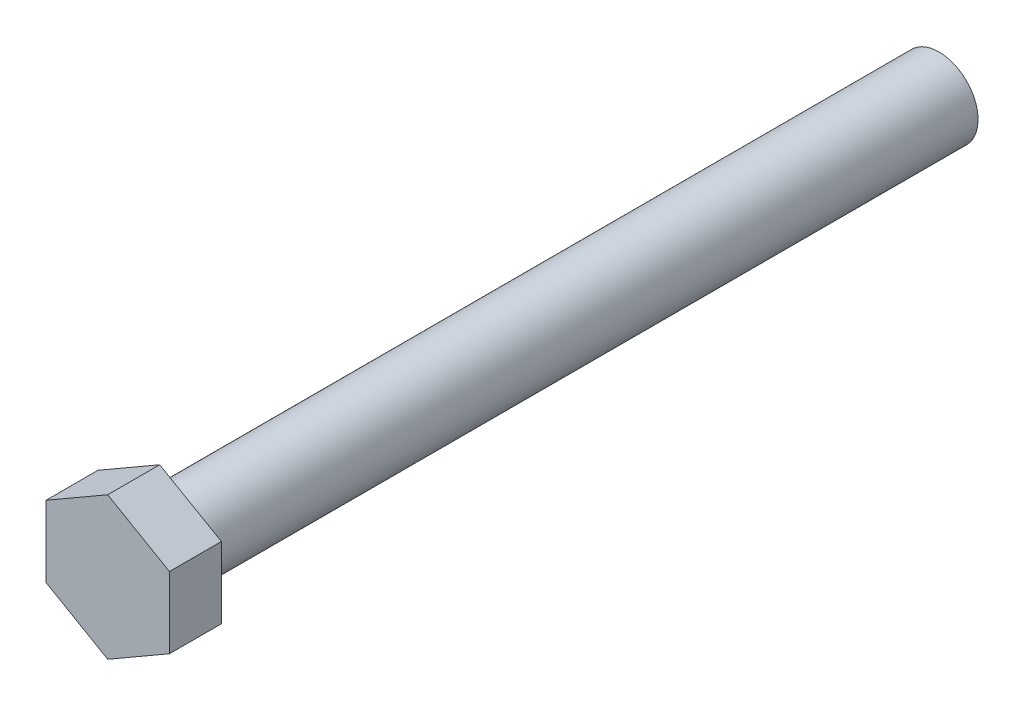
ISO-10303-21;
HEADER;
FILE_DESCRIPTION(('STEP AP214'),'2;1');
FILE_NAME('part.step','',(''),(''),'','','');
FILE_SCHEMA(('AUTOMOTIVE_DESIGN { 1 0 10303 214 1 1 1 1 }'));
ENDSEC;
DATA;
#1=APPLICATION_CONTEXT('core data for automotive mechanical design processes');
#2=APPLICATION_PROTOCOL_DEFINITION('international standard','automotive_design',2000,#1);
#3=PRODUCT_CONTEXT('',#1,'mechanical');
#4=PRODUCT('Part','Part','',(#3));
#5=PRODUCT_RELATED_PRODUCT_CATEGORY('part','',(#4));
#6=PRODUCT_DEFINITION_FORMATION('','',#4);
#7=PRODUCT_DEFINITION_CONTEXT('part definition',#1,'design');
#8=PRODUCT_DEFINITION('design','',#6,#7);
#9=PRODUCT_DEFINITION_SHAPE('','',#8);
#10=(LENGTH_UNIT() NAMED_UNIT(*) SI_UNIT(.MILLI.,.METRE.));
#11=(NAMED_UNIT(*) PLANE_ANGLE_UNIT() SI_UNIT($,.RADIAN.));
#12=(NAMED_UNIT(*) SI_UNIT($,.STERADIAN.) SOLID_ANGLE_UNIT());
#13=UNCERTAINTY_MEASURE_WITH_UNIT(LENGTH_MEASURE(1.E-05),#10,'distance_accuracy_value','');
#14=(GEOMETRIC_REPRESENTATION_CONTEXT(3) GLOBAL_UNCERTAINTY_ASSIGNED_CONTEXT((#13)) GLOBAL_UNIT_ASSIGNED_CONTEXT((#10,
#11,#12)) REPRESENTATION_CONTEXT('',''));
#15=CARTESIAN_POINT('',(0.,0.,0.));
#16=DIRECTION('',(0.,0.,1.));
#17=DIRECTION('',(1.,0.,0.));
#18=AXIS2_PLACEMENT_3D('',#15,#16,#17);
#19=CARTESIAN_POINT('',(0.,10.9696551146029,0.));
#20=DIRECTION('',(0.,0.,1.));
#21=DIRECTION('',(1.,0.,0.));
#22=AXIS2_PLACEMENT_3D('',#19,#20,#21);
#23=PLANE('',#22);
#24=DIRECTION('',(0.866025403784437,0.5,0.));
#25=VECTOR('',#24,1.);
#26=CARTESIAN_POINT('',(-9.5,5.48482755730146,0.));
#27=LINE('',#26,#25);
#28=CARTESIAN_POINT('',(-9.5,5.48482755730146,0.));
#29=VERTEX_POINT('',#28);
#30=CARTESIAN_POINT('',(0.,10.9696551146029,0.));
#31=VERTEX_POINT('',#30);
#32=EDGE_CURVE('E69',#29,#31,#27,.T.);
#33=ORIENTED_EDGE('',*,*,#32,.T.);
#34=DIRECTION('',(-0.866025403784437,0.5,0.));
#35=VECTOR('',#34,1.);
#36=CARTESIAN_POINT('',(9.5,5.48482755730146,0.));
#37=LINE('',#36,#35);
#38=CARTESIAN_POINT('',(9.5,5.48482755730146,0.));
#39=VERTEX_POINT('',#38);
#40=EDGE_CURVE('E83',#39,#31,#37,.T.);
#41=ORIENTED_EDGE('',*,*,#40,.F.);
#42=DIRECTION('',(0.,-1.,0.));
#43=VECTOR('',#42,1.);
#44=CARTESIAN_POINT('',(9.5,5.48482755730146,0.));
#45=LINE('',#44,#43);
#46=CARTESIAN_POINT('',(9.5,-5.48482755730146,0.));
#47=VERTEX_POINT('',#46);
#48=EDGE_CURVE('E90',#39,#47,#45,.T.);
#49=ORIENTED_EDGE('',*,*,#48,.T.);
#50=DIRECTION('',(-0.866025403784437,-0.5,0.));
#51=VECTOR('',#50,1.);
#52=CARTESIAN_POINT('',(9.5,-5.48482755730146,0.));
#53=LINE('',#52,#51);
#54=CARTESIAN_POINT('',(0.,-10.9696551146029,0.));
#55=VERTEX_POINT('',#54);
#56=EDGE_CURVE('E92',#47,#55,#53,.T.);
#57=ORIENTED_EDGE('',*,*,#56,.T.);
#58=DIRECTION('',(0.866025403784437,-0.5,0.));
#59=VECTOR('',#58,1.);
#60=CARTESIAN_POINT('',(-9.5,-5.48482755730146,0.));
#61=LINE('',#60,#59);
#62=CARTESIAN_POINT('',(-9.5,-5.48482755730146,0.));
#63=VERTEX_POINT('',#62);
#64=EDGE_CURVE('E98',#63,#55,#61,.T.);
#65=ORIENTED_EDGE('',*,*,#64,.F.);
#66=DIRECTION('',(0.,-1.,0.));
#67=VECTOR('',#66,1.);
#68=CARTESIAN_POINT('',(-9.5,5.48482755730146,0.));
#69=LINE('',#68,#67);
#70=EDGE_CURVE('E86',#29,#63,#69,.T.);
#71=ORIENTED_EDGE('',*,*,#70,.F.);
#72=EDGE_LOOP('',(#33,#41,#49,#57,#65,#71));
#73=FACE_BOUND('',#72,.T.);
#74=CARTESIAN_POINT('',(0.,0.,0.));
#75=DIRECTION('',(0.,0.,-1.));
#76=DIRECTION('',(-1.,0.,0.));
#77=AXIS2_PLACEMENT_3D('',#74,#75,#76);
#78=CIRCLE('',#77,6.);
#79=CARTESIAN_POINT('',(-6.,0.,0.));
#80=VERTEX_POINT('',#79);
#81=EDGE_CURVE('E9',#80,#80,#78,.T.);
#82=ORIENTED_EDGE('',*,*,#81,.F.);
#83=EDGE_LOOP('',(#82));
#84=FACE_BOUND('',#83,.T.);
#85=ADVANCED_FACE('F14',(#73,#84),#23,.F.);
#86=CARTESIAN_POINT('',(-9.5,5.48482755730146,8.));
#87=DIRECTION('',(-0.5,0.866025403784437,0.));
#88=DIRECTION('',(-0.866025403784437,-0.5,0.));
#89=AXIS2_PLACEMENT_3D('',#86,#87,#88);
#90=PLANE('',#89);
#91=DIRECTION('',(0.,0.,-1.));
#92=VECTOR('',#91,1.);
#93=CARTESIAN_POINT('',(-9.5,5.48482755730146,8.));
#94=LINE('',#93,#92);
#95=CARTESIAN_POINT('',(-9.5,5.48482755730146,8.));
#96=VERTEX_POINT('',#95);
#97=EDGE_CURVE('E18',#96,#29,#94,.T.);
#98=ORIENTED_EDGE('',*,*,#97,.F.);
#99=DIRECTION('',(0.866025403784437,0.5,0.));
#100=VECTOR('',#99,1.);
#101=CARTESIAN_POINT('',(-9.5,5.48482755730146,8.));
#102=LINE('',#101,#100);
#103=CARTESIAN_POINT('',(0.,10.9696551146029,8.));
#104=VERTEX_POINT('',#103);
#105=EDGE_CURVE('E71',#96,#104,#102,.T.);
#106=ORIENTED_EDGE('',*,*,#105,.T.);
#107=DIRECTION('',(0.,0.,-1.));
#108=VECTOR('',#107,1.);
#109=CARTESIAN_POINT('',(0.,10.9696551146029,8.));
#110=LINE('',#109,#108);
#111=EDGE_CURVE('E66',#104,#31,#110,.T.);
#112=ORIENTED_EDGE('',*,*,#111,.T.);
#113=ORIENTED_EDGE('',*,*,#32,.F.);
#114=EDGE_LOOP('',(#98,#106,#112,#113));
#115=FACE_BOUND('',#114,.T.);
#116=ADVANCED_FACE('F68',(#115),#90,.T.);
#117=CARTESIAN_POINT('',(-9.5,5.48482755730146,8.));
#118=DIRECTION('',(1.,0.,0.));
#119=DIRECTION('',(0.,0.,-1.));
#120=AXIS2_PLACEMENT_3D('',#117,#118,#119);
#121=PLANE('',#120);
#122=DIRECTION('',(0.,0.,-1.));
#123=VECTOR('',#122,1.);
#124=CARTESIAN_POINT('',(-9.5,-5.48482755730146,8.));
#125=LINE('',#124,#123);
#126=CARTESIAN_POINT('',(-9.5,-5.48482755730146,8.));
#127=VERTEX_POINT('',#126);
#128=EDGE_CURVE('E37',#127,#63,#125,.T.);
#129=ORIENTED_EDGE('',*,*,#128,.F.);
#130=DIRECTION('',(0.,-1.,0.));
#131=VECTOR('',#130,1.);
#132=CARTESIAN_POINT('',(-9.5,5.48482755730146,8.));
#133=LINE('',#132,#131);
#134=EDGE_CURVE('E77',#96,#127,#133,.T.);
#135=ORIENTED_EDGE('',*,*,#134,.F.);
#136=ORIENTED_EDGE('',*,*,#97,.T.);
#137=ORIENTED_EDGE('',*,*,#70,.T.);
#138=EDGE_LOOP('',(#129,#135,#136,#137));
#139=FACE_BOUND('',#138,.T.);
#140=ADVANCED_FACE('F16',(#139),#121,.F.);
#141=CARTESIAN_POINT('',(-9.5,-5.48482755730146,8.));
#142=DIRECTION('',(0.5,0.866025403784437,0.));
#143=DIRECTION('',(-0.866025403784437,0.5,0.));
#144=AXIS2_PLACEMENT_3D('',#141,#142,#143);
#145=PLANE('',#144);
#146=DIRECTION('',(0.,0.,-1.));
#147=VECTOR('',#146,1.);
#148=CARTESIAN_POINT('',(0.,-10.9696551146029,8.));
#149=LINE('',#148,#147);
#150=CARTESIAN_POINT('',(0.,-10.9696551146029,8.));
#151=VERTEX_POINT('',#150);
#152=EDGE_CURVE('E119',#151,#55,#149,.T.);
#153=ORIENTED_EDGE('',*,*,#152,.F.);
#154=DIRECTION('',(0.866025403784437,-0.5,0.));
#155=VECTOR('',#154,1.);
#156=CARTESIAN_POINT('',(-9.5,-5.48482755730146,8.));
#157=LINE('',#156,#155);
#158=EDGE_CURVE('E111',#127,#151,#157,.T.);
#159=ORIENTED_EDGE('',*,*,#158,.F.);
#160=ORIENTED_EDGE('',*,*,#128,.T.);
#161=ORIENTED_EDGE('',*,*,#64,.T.);
#162=EDGE_LOOP('',(#153,#159,#160,#161));
#163=FACE_BOUND('',#162,.T.);
#164=ADVANCED_FACE('F130',(#163),#145,.F.);
#165=CARTESIAN_POINT('',(9.5,-5.48482755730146,8.));
#166=DIRECTION('',(0.5,-0.866025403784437,0.));
#167=DIRECTION('',(0.866025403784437,0.5,0.));
#168=AXIS2_PLACEMENT_3D('',#165,#166,#167);
#169=PLANE('',#168);
#170=DIRECTION('',(0.,0.,-1.));
#171=VECTOR('',#170,1.);
#172=CARTESIAN_POINT('',(9.5,-5.48482755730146,8.));
#173=LINE('',#172,#171);
#174=CARTESIAN_POINT('',(9.5,-5.48482755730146,8.));
#175=VERTEX_POINT('',#174);
#176=EDGE_CURVE('E117',#175,#47,#173,.T.);
#177=ORIENTED_EDGE('',*,*,#176,.F.);
#178=DIRECTION('',(-0.866025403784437,-0.5,0.));
#179=VECTOR('',#178,1.);
#180=CARTESIAN_POINT('',(9.5,-5.48482755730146,8.));
#181=LINE('',#180,#179);
#182=EDGE_CURVE('E108',#175,#151,#181,.T.);
#183=ORIENTED_EDGE('',*,*,#182,.T.);
#184=ORIENTED_EDGE('',*,*,#152,.T.);
#185=ORIENTED_EDGE('',*,*,#56,.F.);
#186=EDGE_LOOP('',(#177,#183,#184,#185));
#187=FACE_BOUND('',#186,.T.);
#188=ADVANCED_FACE('F129',(#187),#169,.T.);
#189=CARTESIAN_POINT('',(9.5,5.48482755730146,8.));
#190=DIRECTION('',(1.,0.,0.));
#191=DIRECTION('',(0.,0.,-1.));
#192=AXIS2_PLACEMENT_3D('',#189,#190,#191);
#193=PLANE('',#192);
#194=DIRECTION('',(0.,0.,-1.));
#195=VECTOR('',#194,1.);
#196=CARTESIAN_POINT('',(9.5,5.48482755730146,8.));
#197=LINE('',#196,#195);
#198=CARTESIAN_POINT('',(9.5,5.48482755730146,8.));
#199=VERTEX_POINT('',#198);
#200=EDGE_CURVE('E76',#199,#39,#197,.T.);
#201=ORIENTED_EDGE('',*,*,#200,.F.);
#202=DIRECTION('',(0.,-1.,0.));
#203=VECTOR('',#202,1.);
#204=CARTESIAN_POINT('',(9.5,5.48482755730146,8.));
#205=LINE('',#204,#203);
#206=EDGE_CURVE('E105',#199,#175,#205,.T.);
#207=ORIENTED_EDGE('',*,*,#206,.T.);
#208=ORIENTED_EDGE('',*,*,#176,.T.);
#209=ORIENTED_EDGE('',*,*,#48,.F.);
#210=EDGE_LOOP('',(#201,#207,#208,#209));
#211=FACE_BOUND('',#210,.T.);
#212=ADVANCED_FACE('F126',(#211),#193,.T.);
#213=CARTESIAN_POINT('',(9.5,5.48482755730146,8.));
#214=DIRECTION('',(-0.5,-0.866025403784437,0.));
#215=DIRECTION('',(0.866025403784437,-0.5,0.));
#216=AXIS2_PLACEMENT_3D('',#213,#214,#215);
#217=PLANE('',#216);
#218=DIRECTION('',(-0.866025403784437,0.5,0.));
#219=VECTOR('',#218,1.);
#220=CARTESIAN_POINT('',(9.5,5.48482755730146,8.));
#221=LINE('',#220,#219);
#222=EDGE_CURVE('E103',#199,#104,#221,.T.);
#223=ORIENTED_EDGE('',*,*,#222,.F.);
#224=ORIENTED_EDGE('',*,*,#200,.T.);
#225=ORIENTED_EDGE('',*,*,#40,.T.);
#226=ORIENTED_EDGE('',*,*,#111,.F.);
#227=EDGE_LOOP('',(#223,#224,#225,#226));
#228=FACE_BOUND('',#227,.T.);
#229=ADVANCED_FACE('F89',(#228),#217,.F.);
#230=CARTESIAN_POINT('',(0.,10.9696551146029,8.));
#231=DIRECTION('',(0.,0.,1.));
#232=DIRECTION('',(1.,0.,0.));
#233=AXIS2_PLACEMENT_3D('',#230,#231,#232);
#234=PLANE('',#233);
#235=ORIENTED_EDGE('',*,*,#105,.F.);
#236=ORIENTED_EDGE('',*,*,#134,.T.);
#237=ORIENTED_EDGE('',*,*,#158,.T.);
#238=ORIENTED_EDGE('',*,*,#182,.F.);
#239=ORIENTED_EDGE('',*,*,#206,.F.);
#240=ORIENTED_EDGE('',*,*,#222,.T.);
#241=EDGE_LOOP('',(#235,#236,#237,#238,#239,#240));
#242=FACE_BOUND('',#241,.T.);
#243=ADVANCED_FACE('F122',(#242),#234,.T.);
#244=CARTESIAN_POINT('',(0.,0.,-120.));
#245=DIRECTION('',(0.,0.,1.));
#246=DIRECTION('',(1.,0.,0.));
#247=AXIS2_PLACEMENT_3D('',#244,#245,#246);
#248=CYLINDRICAL_SURFACE('',#247,6.);
#249=CARTESIAN_POINT('',(0.,0.,-120.));
#250=DIRECTION('',(0.,0.,-1.));
#251=DIRECTION('',(-1.,0.,0.));
#252=AXIS2_PLACEMENT_3D('',#249,#250,#251);
#253=CIRCLE('',#252,6.);
#254=CARTESIAN_POINT('',(-6.,0.,-120.));
#255=VERTEX_POINT('',#254);
#256=EDGE_CURVE('E87',#255,#255,#253,.T.);
#257=ORIENTED_EDGE('',*,*,#256,.F.);
#258=EDGE_LOOP('',(#257));
#259=FACE_BOUND('',#258,.T.);
#260=ORIENTED_EDGE('',*,*,#81,.T.);
#261=EDGE_LOOP('',(#260));
#262=FACE_BOUND('',#261,.T.);
#263=ADVANCED_FACE('F148',(#259,#262),#248,.T.);
#264=CARTESIAN_POINT('',(0.,0.,-120.));
#265=DIRECTION('',(0.,0.,-1.));
#266=DIRECTION('',(-1.,0.,0.));
#267=AXIS2_PLACEMENT_3D('',#264,#265,#266);
#268=PLANE('',#267);
#269=ORIENTED_EDGE('',*,*,#256,.T.);
#270=EDGE_LOOP('',(#269));
#271=FACE_BOUND('',#270,.T.);
#272=ADVANCED_FACE('F154',(#271),#268,.T.);
#273=CLOSED_SHELL('',(#85,#116,#140,#164,#188,#212,#229,#243,#263,#272));
#274=MANIFOLD_SOLID_BREP('B1',#273);
#275=ADVANCED_BREP_SHAPE_REPRESENTATION('',(#18,#274),#14);
#276=SHAPE_DEFINITION_REPRESENTATION(#9,#275);
ENDSEC;
END-ISO-10303-21;
